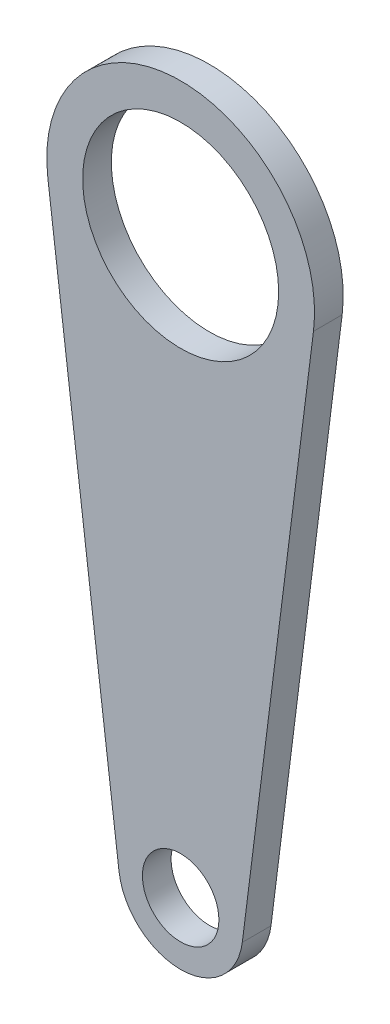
ISO-10303-21;
HEADER;
FILE_DESCRIPTION(('STEP AP214'),'2;1');
FILE_NAME('part.step','',(''),(''),'','','');
FILE_SCHEMA(('AUTOMOTIVE_DESIGN { 1 0 10303 214 1 1 1 1 }'));
ENDSEC;
DATA;
#1=APPLICATION_CONTEXT('core data for automotive mechanical design processes');
#2=APPLICATION_PROTOCOL_DEFINITION('international standard','automotive_design',2000,#1);
#3=PRODUCT_CONTEXT('',#1,'mechanical');
#4=PRODUCT('Part','Part','',(#3));
#5=PRODUCT_RELATED_PRODUCT_CATEGORY('part','',(#4));
#6=PRODUCT_DEFINITION_FORMATION('','',#4);
#7=PRODUCT_DEFINITION_CONTEXT('part definition',#1,'design');
#8=PRODUCT_DEFINITION('design','',#6,#7);
#9=PRODUCT_DEFINITION_SHAPE('','',#8);
#10=(LENGTH_UNIT() NAMED_UNIT(*) SI_UNIT(.MILLI.,.METRE.));
#11=(NAMED_UNIT(*) PLANE_ANGLE_UNIT() SI_UNIT($,.RADIAN.));
#12=(NAMED_UNIT(*) SI_UNIT($,.STERADIAN.) SOLID_ANGLE_UNIT());
#13=UNCERTAINTY_MEASURE_WITH_UNIT(LENGTH_MEASURE(1.E-05),#10,'distance_accuracy_value','');
#14=(GEOMETRIC_REPRESENTATION_CONTEXT(3) GLOBAL_UNCERTAINTY_ASSIGNED_CONTEXT((#13)) GLOBAL_UNIT_ASSIGNED_CONTEXT((#10,
#11,#12)) REPRESENTATION_CONTEXT('',''));
#15=CARTESIAN_POINT('',(0.,0.,0.));
#16=DIRECTION('',(0.,0.,1.));
#17=DIRECTION('',(1.,0.,0.));
#18=AXIS2_PLACEMENT_3D('',#15,#16,#17);
#19=CARTESIAN_POINT('',(0.,60.,1.5));
#20=DIRECTION('',(0.,0.,1.));
#21=DIRECTION('',(1.,0.,0.));
#22=AXIS2_PLACEMENT_3D('',#19,#20,#21);
#23=PLANE('',#22);
#24=CARTESIAN_POINT('',(0.,60.,1.5));
#25=DIRECTION('',(0.,0.,1.));
#26=DIRECTION('',(1.,0.,0.));
#27=AXIS2_PLACEMENT_3D('',#24,#25,#26);
#28=CIRCLE('',#27,10.25);
#29=CARTESIAN_POINT('',(10.25,60.,1.5));
#30=VERTEX_POINT('',#29);
#31=EDGE_CURVE('E90',#30,#30,#28,.T.);
#32=ORIENTED_EDGE('',*,*,#31,.F.);
#33=EDGE_LOOP('',(#32));
#34=FACE_BOUND('',#33,.T.);
#35=CARTESIAN_POINT('',(0.,60.,1.5));
#36=DIRECTION('',(0.,0.,1.));
#37=DIRECTION('',(1.,0.,0.));
#38=AXIS2_PLACEMENT_3D('',#35,#36,#37);
#39=CIRCLE('',#38,14.);
#40=CARTESIAN_POINT('',(13.8901943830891,58.25,1.5));
#41=VERTEX_POINT('',#40);
#42=CARTESIAN_POINT('',(-13.8901943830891,58.25,1.5));
#43=VERTEX_POINT('',#42);
#44=EDGE_CURVE('E100',#41,#43,#39,.T.);
#45=ORIENTED_EDGE('',*,*,#44,.T.);
#46=DIRECTION('',(0.125,-0.992156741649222,0.));
#47=VECTOR('',#46,1.);
#48=CARTESIAN_POINT('',(-13.8901943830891,58.25,1.5));
#49=LINE('',#48,#47);
#50=CARTESIAN_POINT('',(-6.44901882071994,-0.812499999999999,1.5));
#51=VERTEX_POINT('',#50);
#52=EDGE_CURVE('E87',#43,#51,#49,.T.);
#53=ORIENTED_EDGE('',*,*,#52,.T.);
#54=CARTESIAN_POINT('',(0.,0.,1.5));
#55=DIRECTION('',(0.,0.,1.));
#56=DIRECTION('',(1.,0.,0.));
#57=AXIS2_PLACEMENT_3D('',#54,#55,#56);
#58=CIRCLE('',#57,6.5);
#59=CARTESIAN_POINT('',(6.44901882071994,-0.812500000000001,1.5));
#60=VERTEX_POINT('',#59);
#61=EDGE_CURVE('E53',#51,#60,#58,.T.);
#62=ORIENTED_EDGE('',*,*,#61,.T.);
#63=DIRECTION('',(-0.125,-0.992156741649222,0.));
#64=VECTOR('',#63,1.);
#65=CARTESIAN_POINT('',(13.8901943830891,58.25,1.5));
#66=LINE('',#65,#64);
#67=EDGE_CURVE('E104',#41,#60,#66,.T.);
#68=ORIENTED_EDGE('',*,*,#67,.F.);
#69=EDGE_LOOP('',(#45,#53,#62,#68));
#70=FACE_BOUND('',#69,.T.);
#71=CARTESIAN_POINT('',(0.,0.,1.5));
#72=DIRECTION('',(0.,0.,1.));
#73=DIRECTION('',(1.,0.,0.));
#74=AXIS2_PLACEMENT_3D('',#71,#72,#73);
#75=CIRCLE('',#74,4.);
#76=CARTESIAN_POINT('',(4.,0.,1.5));
#77=VERTEX_POINT('',#76);
#78=EDGE_CURVE('E117',#77,#77,#75,.T.);
#79=ORIENTED_EDGE('',*,*,#78,.F.);
#80=EDGE_LOOP('',(#79));
#81=FACE_BOUND('',#80,.T.);
#82=ADVANCED_FACE('F30',(#34,#70,#81),#23,.T.);
#83=CARTESIAN_POINT('',(0.,60.,-1.5));
#84=DIRECTION('',(0.,0.,1.));
#85=DIRECTION('',(1.,0.,0.));
#86=AXIS2_PLACEMENT_3D('',#83,#84,#85);
#87=PLANE('',#86);
#88=CARTESIAN_POINT('',(0.,60.,-1.5));
#89=DIRECTION('',(0.,0.,1.));
#90=DIRECTION('',(1.,0.,0.));
#91=AXIS2_PLACEMENT_3D('',#88,#89,#90);
#92=CIRCLE('',#91,10.25);
#93=CARTESIAN_POINT('',(10.25,60.,-1.5));
#94=VERTEX_POINT('',#93);
#95=EDGE_CURVE('E93',#94,#94,#92,.T.);
#96=ORIENTED_EDGE('',*,*,#95,.T.);
#97=EDGE_LOOP('',(#96));
#98=FACE_BOUND('',#97,.T.);
#99=CARTESIAN_POINT('',(0.,60.,-1.5));
#100=DIRECTION('',(0.,0.,1.));
#101=DIRECTION('',(1.,0.,0.));
#102=AXIS2_PLACEMENT_3D('',#99,#100,#101);
#103=CIRCLE('',#102,14.);
#104=CARTESIAN_POINT('',(13.8901943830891,58.25,-1.5));
#105=VERTEX_POINT('',#104);
#106=CARTESIAN_POINT('',(-13.8901943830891,58.25,-1.5));
#107=VERTEX_POINT('',#106);
#108=EDGE_CURVE('E78',#105,#107,#103,.T.);
#109=ORIENTED_EDGE('',*,*,#108,.F.);
#110=DIRECTION('',(-0.125,-0.992156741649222,0.));
#111=VECTOR('',#110,1.);
#112=CARTESIAN_POINT('',(13.8901943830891,58.25,-1.5));
#113=LINE('',#112,#111);
#114=CARTESIAN_POINT('',(6.44901882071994,-0.812500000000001,-1.5));
#115=VERTEX_POINT('',#114);
#116=EDGE_CURVE('E98',#105,#115,#113,.T.);
#117=ORIENTED_EDGE('',*,*,#116,.T.);
#118=CARTESIAN_POINT('',(0.,0.,-1.5));
#119=DIRECTION('',(0.,0.,1.));
#120=DIRECTION('',(1.,0.,0.));
#121=AXIS2_PLACEMENT_3D('',#118,#119,#120);
#122=CIRCLE('',#121,6.5);
#123=CARTESIAN_POINT('',(-6.44901882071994,-0.812499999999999,-1.5));
#124=VERTEX_POINT('',#123);
#125=EDGE_CURVE('E80',#124,#115,#122,.T.);
#126=ORIENTED_EDGE('',*,*,#125,.F.);
#127=DIRECTION('',(0.125,-0.992156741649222,0.));
#128=VECTOR('',#127,1.);
#129=CARTESIAN_POINT('',(-13.8901943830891,58.25,-1.5));
#130=LINE('',#129,#128);
#131=EDGE_CURVE('E73',#107,#124,#130,.T.);
#132=ORIENTED_EDGE('',*,*,#131,.F.);
#133=EDGE_LOOP('',(#109,#117,#126,#132));
#134=FACE_BOUND('',#133,.T.);
#135=CARTESIAN_POINT('',(0.,0.,-1.5));
#136=DIRECTION('',(0.,0.,1.));
#137=DIRECTION('',(1.,0.,0.));
#138=AXIS2_PLACEMENT_3D('',#135,#136,#137);
#139=CIRCLE('',#138,4.);
#140=CARTESIAN_POINT('',(4.,0.,-1.5));
#141=VERTEX_POINT('',#140);
#142=EDGE_CURVE('E119',#141,#141,#139,.T.);
#143=ORIENTED_EDGE('',*,*,#142,.T.);
#144=EDGE_LOOP('',(#143));
#145=FACE_BOUND('',#144,.T.);
#146=ADVANCED_FACE('F74',(#98,#134,#145),#87,.F.);
#147=CARTESIAN_POINT('',(0.,60.,1.5));
#148=DIRECTION('',(0.,0.,-1.));
#149=DIRECTION('',(-1.,0.,0.));
#150=AXIS2_PLACEMENT_3D('',#147,#148,#149);
#151=CYLINDRICAL_SURFACE('',#150,14.);
#152=ORIENTED_EDGE('',*,*,#108,.T.);
#153=DIRECTION('',(0.,0.,-1.));
#154=VECTOR('',#153,1.);
#155=CARTESIAN_POINT('',(-13.8901943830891,58.25,1.5));
#156=LINE('',#155,#154);
#157=EDGE_CURVE('E11',#43,#107,#156,.T.);
#158=ORIENTED_EDGE('',*,*,#157,.F.);
#159=ORIENTED_EDGE('',*,*,#44,.F.);
#160=DIRECTION('',(0.,0.,-1.));
#161=VECTOR('',#160,1.);
#162=CARTESIAN_POINT('',(13.8901943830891,58.25,1.5));
#163=LINE('',#162,#161);
#164=EDGE_CURVE('E45',#41,#105,#163,.T.);
#165=ORIENTED_EDGE('',*,*,#164,.T.);
#166=EDGE_LOOP('',(#152,#158,#159,#165));
#167=FACE_BOUND('',#166,.T.);
#168=ADVANCED_FACE('F32',(#167),#151,.T.);
#169=CARTESIAN_POINT('',(-13.8901943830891,58.25,1.5));
#170=DIRECTION('',(0.992156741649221,0.125,0.));
#171=DIRECTION('',(-0.125,0.992156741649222,0.));
#172=AXIS2_PLACEMENT_3D('',#169,#170,#171);
#173=PLANE('',#172);
#174=ORIENTED_EDGE('',*,*,#131,.T.);
#175=DIRECTION('',(0.,0.,-1.));
#176=VECTOR('',#175,1.);
#177=CARTESIAN_POINT('',(-6.44901882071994,-0.812499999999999,1.5));
#178=LINE('',#177,#176);
#179=EDGE_CURVE('E38',#51,#124,#178,.T.);
#180=ORIENTED_EDGE('',*,*,#179,.F.);
#181=ORIENTED_EDGE('',*,*,#52,.F.);
#182=ORIENTED_EDGE('',*,*,#157,.T.);
#183=EDGE_LOOP('',(#174,#180,#181,#182));
#184=FACE_BOUND('',#183,.T.);
#185=ADVANCED_FACE('F86',(#184),#173,.F.);
#186=CARTESIAN_POINT('',(0.,0.,1.5));
#187=DIRECTION('',(0.,0.,-1.));
#188=DIRECTION('',(-1.,0.,0.));
#189=AXIS2_PLACEMENT_3D('',#186,#187,#188);
#190=CYLINDRICAL_SURFACE('',#189,6.5);
#191=ORIENTED_EDGE('',*,*,#125,.T.);
#192=DIRECTION('',(0.,0.,-1.));
#193=VECTOR('',#192,1.);
#194=CARTESIAN_POINT('',(6.44901882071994,-0.812500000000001,1.5));
#195=LINE('',#194,#193);
#196=EDGE_CURVE('E107',#60,#115,#195,.T.);
#197=ORIENTED_EDGE('',*,*,#196,.F.);
#198=ORIENTED_EDGE('',*,*,#61,.F.);
#199=ORIENTED_EDGE('',*,*,#179,.T.);
#200=EDGE_LOOP('',(#191,#197,#198,#199));
#201=FACE_BOUND('',#200,.T.);
#202=ADVANCED_FACE('F109',(#201),#190,.T.);
#203=CARTESIAN_POINT('',(13.8901943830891,58.25,1.5));
#204=DIRECTION('',(0.992156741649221,-0.125,0.));
#205=DIRECTION('',(0.125,0.992156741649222,0.));
#206=AXIS2_PLACEMENT_3D('',#203,#204,#205);
#207=PLANE('',#206);
#208=ORIENTED_EDGE('',*,*,#116,.F.);
#209=ORIENTED_EDGE('',*,*,#164,.F.);
#210=ORIENTED_EDGE('',*,*,#67,.T.);
#211=ORIENTED_EDGE('',*,*,#196,.T.);
#212=EDGE_LOOP('',(#208,#209,#210,#211));
#213=FACE_BOUND('',#212,.T.);
#214=ADVANCED_FACE('F110',(#213),#207,.T.);
#215=CARTESIAN_POINT('',(0.,60.,1.5));
#216=DIRECTION('',(0.,0.,-1.));
#217=DIRECTION('',(-1.,0.,0.));
#218=AXIS2_PLACEMENT_3D('',#215,#216,#217);
#219=CYLINDRICAL_SURFACE('',#218,10.25);
#220=ORIENTED_EDGE('',*,*,#31,.T.);
#221=EDGE_LOOP('',(#220));
#222=FACE_BOUND('',#221,.T.);
#223=ORIENTED_EDGE('',*,*,#95,.F.);
#224=EDGE_LOOP('',(#223));
#225=FACE_BOUND('',#224,.T.);
#226=ADVANCED_FACE('F128',(#222,#225),#219,.F.);
#227=CARTESIAN_POINT('',(0.,0.,1.5));
#228=DIRECTION('',(0.,0.,-1.));
#229=DIRECTION('',(-1.,0.,0.));
#230=AXIS2_PLACEMENT_3D('',#227,#228,#229);
#231=CYLINDRICAL_SURFACE('',#230,4.);
#232=ORIENTED_EDGE('',*,*,#78,.T.);
#233=EDGE_LOOP('',(#232));
#234=FACE_BOUND('',#233,.T.);
#235=ORIENTED_EDGE('',*,*,#142,.F.);
#236=EDGE_LOOP('',(#235));
#237=FACE_BOUND('',#236,.T.);
#238=ADVANCED_FACE('F126',(#234,#237),#231,.F.);
#239=CLOSED_SHELL('',(#82,#146,#168,#185,#202,#214,#226,#238));
#240=MANIFOLD_SOLID_BREP('B2',#239);
#241=ADVANCED_BREP_SHAPE_REPRESENTATION('',(#18,#240),#14);
#242=SHAPE_DEFINITION_REPRESENTATION(#9,#241);
ENDSEC;
END-ISO-10303-21;
